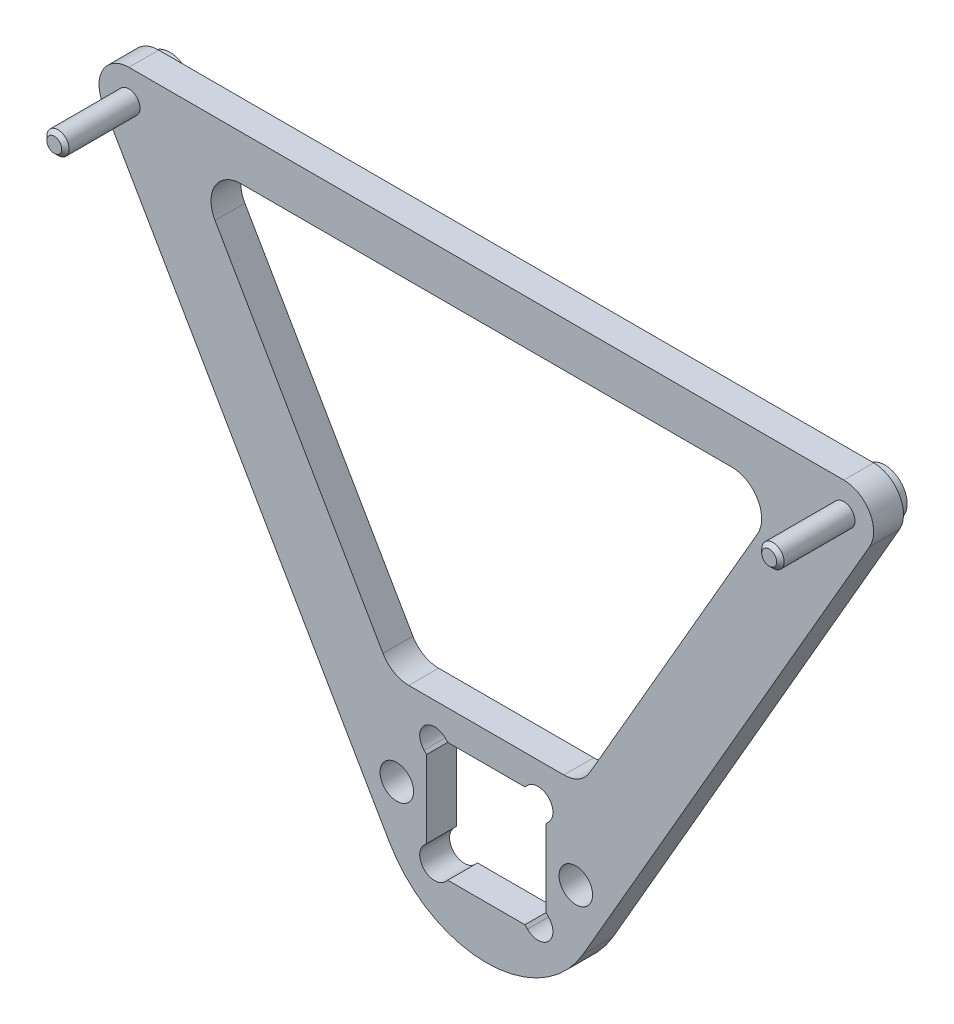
ISO-10303-21;
HEADER;
FILE_DESCRIPTION(('STEP AP214'),'2;1');
FILE_NAME('part.step','',(''),(''),'','','');
FILE_SCHEMA(('AUTOMOTIVE_DESIGN { 1 0 10303 214 1 1 1 1 }'));
ENDSEC;
DATA;
#1=APPLICATION_CONTEXT('core data for automotive mechanical design processes');
#2=APPLICATION_PROTOCOL_DEFINITION('international standard','automotive_design',2000,#1);
#3=PRODUCT_CONTEXT('',#1,'mechanical');
#4=PRODUCT('Part','Part','',(#3));
#5=PRODUCT_RELATED_PRODUCT_CATEGORY('part','',(#4));
#6=PRODUCT_DEFINITION_FORMATION('','',#4);
#7=PRODUCT_DEFINITION_CONTEXT('part definition',#1,'design');
#8=PRODUCT_DEFINITION('design','',#6,#7);
#9=PRODUCT_DEFINITION_SHAPE('','',#8);
#10=(LENGTH_UNIT() NAMED_UNIT(*) SI_UNIT(.MILLI.,.METRE.));
#11=(NAMED_UNIT(*) PLANE_ANGLE_UNIT() SI_UNIT($,.RADIAN.));
#12=(NAMED_UNIT(*) SI_UNIT($,.STERADIAN.) SOLID_ANGLE_UNIT());
#13=UNCERTAINTY_MEASURE_WITH_UNIT(LENGTH_MEASURE(1.E-05),#10,'distance_accuracy_value','');
#14=(GEOMETRIC_REPRESENTATION_CONTEXT(3) GLOBAL_UNCERTAINTY_ASSIGNED_CONTEXT((#13)) GLOBAL_UNIT_ASSIGNED_CONTEXT((#10,
#11,#12)) REPRESENTATION_CONTEXT('',''));
#15=CARTESIAN_POINT('',(0.,0.,0.));
#16=DIRECTION('',(0.,0.,1.));
#17=DIRECTION('',(1.,0.,0.));
#18=AXIS2_PLACEMENT_3D('',#15,#16,#17);
#19=CARTESIAN_POINT('',(47.9200723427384,61.,-2.));
#20=DIRECTION('',(0.,0.,1.));
#21=DIRECTION('',(1.,0.,0.));
#22=AXIS2_PLACEMENT_3D('',#19,#20,#21);
#23=PLANE('',#22);
#24=CARTESIAN_POINT('',(47.9200723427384,61.,-2.));
#25=DIRECTION('',(0.,0.,1.));
#26=DIRECTION('',(1.,0.,0.));
#27=AXIS2_PLACEMENT_3D('',#24,#25,#26);
#28=CIRCLE('',#27,3.);
#29=CARTESIAN_POINT('',(50.9200723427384,61.,-2.));
#30=VERTEX_POINT('',#29);
#31=EDGE_CURVE('E457',#30,#30,#28,.F.);
#32=ORIENTED_EDGE('',*,*,#31,.F.);
#33=EDGE_LOOP('',(#32));
#34=FACE_BOUND('',#33,.T.);
#35=CARTESIAN_POINT('',(-12.,0.,-2.));
#36=DIRECTION('',(0.,0.,1.));
#37=DIRECTION('',(1.,0.,0.));
#38=AXIS2_PLACEMENT_3D('',#35,#36,#37);
#39=CIRCLE('',#38,2.25);
#40=CARTESIAN_POINT('',(-9.75,0.,-2.));
#41=VERTEX_POINT('',#40);
#42=EDGE_CURVE('E995',#41,#41,#39,.T.);
#43=ORIENTED_EDGE('',*,*,#42,.T.);
#44=EDGE_LOOP('',(#43));
#45=FACE_BOUND('',#44,.T.);
#46=DIRECTION('',(0.707106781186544,0.707106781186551,0.));
#47=VECTOR('',#46,1.);
#48=CARTESIAN_POINT('',(8.34386001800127,5.51543289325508,-2.));
#49=LINE('',#48,#47);
#50=CARTESIAN_POINT('',(8.,5.17157287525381,-2.));
#51=VERTEX_POINT('',#50);
#52=CARTESIAN_POINT('',(8.34386001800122,5.51543289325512,-2.));
#53=VERTEX_POINT('',#52);
#54=EDGE_CURVE('E246',#51,#53,#49,.T.);
#55=ORIENTED_EDGE('',*,*,#54,.T.);
#56=CARTESIAN_POINT('',(6.92964645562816,6.92964645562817,-2.));
#57=DIRECTION('',(0.,0.,1.));
#58=DIRECTION('',(1.,0.,0.));
#59=AXIS2_PLACEMENT_3D('',#56,#57,#58);
#60=CIRCLE('',#59,1.99999999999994);
#61=CARTESIAN_POINT('',(5.51543289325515,8.34386001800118,-2.));
#62=VERTEX_POINT('',#61);
#63=EDGE_CURVE('E336',#53,#62,#60,.T.);
#64=ORIENTED_EDGE('',*,*,#63,.T.);
#65=DIRECTION('',(-0.707106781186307,-0.707106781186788,0.));
#66=VECTOR('',#65,1.);
#67=CARTESIAN_POINT('',(5.51543289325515,8.34386001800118,-2.));
#68=LINE('',#67,#66);
#69=CARTESIAN_POINT('',(5.17157287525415,7.99999999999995,-2.));
#70=VERTEX_POINT('',#69);
#71=EDGE_CURVE('E339',#62,#70,#68,.T.);
#72=ORIENTED_EDGE('',*,*,#71,.T.);
#73=DIRECTION('',(-1.,0.,0.));
#74=VECTOR('',#73,1.);
#75=CARTESIAN_POINT('',(-5.17157287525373,8.00000000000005,-2.));
#76=LINE('',#75,#74);
#77=CARTESIAN_POINT('',(-5.17157287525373,8.00000000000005,-2.));
#78=VERTEX_POINT('',#77);
#79=EDGE_CURVE('E342',#70,#78,#76,.T.);
#80=ORIENTED_EDGE('',*,*,#79,.T.);
#81=DIRECTION('',(-0.707106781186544,0.707106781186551,0.));
#82=VECTOR('',#81,1.);
#83=CARTESIAN_POINT('',(-5.515432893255,8.34386001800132,-2.));
#84=LINE('',#83,#82);
#85=CARTESIAN_POINT('',(-5.515432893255,8.34386001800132,-2.));
#86=VERTEX_POINT('',#85);
#87=EDGE_CURVE('E345',#78,#86,#84,.T.);
#88=ORIENTED_EDGE('',*,*,#87,.T.);
#89=CARTESIAN_POINT('',(-6.9296464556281,6.92964645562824,-2.));
#90=DIRECTION('',(0.,0.,1.));
#91=DIRECTION('',(1.,0.,0.));
#92=AXIS2_PLACEMENT_3D('',#89,#90,#91);
#93=CIRCLE('',#92,2.);
#94=CARTESIAN_POINT('',(-8.3438600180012,5.51543289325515,-2.));
#95=VERTEX_POINT('',#94);
#96=EDGE_CURVE('E348',#86,#95,#93,.T.);
#97=ORIENTED_EDGE('',*,*,#96,.T.);
#98=DIRECTION('',(0.70710678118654,-0.707106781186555,0.));
#99=VECTOR('',#98,1.);
#100=CARTESIAN_POINT('',(-8.3438600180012,5.51543289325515,-2.));
#101=LINE('',#100,#99);
#102=CARTESIAN_POINT('',(-7.99999999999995,5.17157287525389,-2.));
#103=VERTEX_POINT('',#102);
#104=EDGE_CURVE('E351',#95,#103,#101,.T.);
#105=ORIENTED_EDGE('',*,*,#104,.T.);
#106=DIRECTION('',(0.,-1.,0.));
#107=VECTOR('',#106,1.);
#108=CARTESIAN_POINT('',(-7.99999999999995,5.17157287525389,-2.));
#109=LINE('',#108,#107);
#110=CARTESIAN_POINT('',(-8.00000000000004,-5.17157287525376,-2.));
#111=VERTEX_POINT('',#110);
#112=EDGE_CURVE('E354',#103,#111,#109,.T.);
#113=ORIENTED_EDGE('',*,*,#112,.T.);
#114=DIRECTION('',(-0.707106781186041,-0.707106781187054,0.));
#115=VECTOR('',#114,1.);
#116=CARTESIAN_POINT('',(-8.34386001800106,-5.51543289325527,-2.));
#117=LINE('',#116,#115);
#118=CARTESIAN_POINT('',(-8.34386001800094,-5.5154328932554,-2.));
#119=VERTEX_POINT('',#118);
#120=EDGE_CURVE('E357',#111,#119,#117,.T.);
#121=ORIENTED_EDGE('',*,*,#120,.T.);
#122=CARTESIAN_POINT('',(-6.92964645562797,-6.92964645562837,-2.));
#123=DIRECTION('',(0.,0.,1.));
#124=DIRECTION('',(1.,0.,0.));
#125=AXIS2_PLACEMENT_3D('',#122,#123,#124);
#126=CIRCLE('',#125,1.99999999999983);
#127=CARTESIAN_POINT('',(-5.51543289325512,-8.34386001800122,-2.));
#128=VERTEX_POINT('',#127);
#129=EDGE_CURVE('E360',#119,#128,#126,.T.);
#130=ORIENTED_EDGE('',*,*,#129,.T.);
#131=DIRECTION('',(0.707106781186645,0.70710678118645,0.));
#132=VECTOR('',#131,1.);
#133=CARTESIAN_POINT('',(-5.51543289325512,-8.34386001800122,-2.));
#134=LINE('',#133,#132);
#135=CARTESIAN_POINT('',(-5.17157287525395,-8.00000000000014,-2.));
#136=VERTEX_POINT('',#135);
#137=EDGE_CURVE('E363',#128,#136,#134,.T.);
#138=ORIENTED_EDGE('',*,*,#137,.T.);
#139=DIRECTION('',(1.,0.,0.));
#140=VECTOR('',#139,1.);
#141=CARTESIAN_POINT('',(-5.17157287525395,-8.00000000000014,-2.));
#142=LINE('',#141,#140);
#143=CARTESIAN_POINT('',(5.17157287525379,-8.00000000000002,-2.));
#144=VERTEX_POINT('',#143);
#145=EDGE_CURVE('E366',#136,#144,#142,.T.);
#146=ORIENTED_EDGE('',*,*,#145,.T.);
#147=DIRECTION('',(0.707106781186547,-0.707106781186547,0.));
#148=VECTOR('',#147,1.);
#149=CARTESIAN_POINT('',(5.51543289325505,-8.34386001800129,-2.));
#150=LINE('',#149,#148);
#151=CARTESIAN_POINT('',(5.51543289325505,-8.34386001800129,-2.));
#152=VERTEX_POINT('',#151);
#153=EDGE_CURVE('E369',#144,#152,#150,.T.);
#154=ORIENTED_EDGE('',*,*,#153,.T.);
#155=CARTESIAN_POINT('',(6.92964645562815,-6.92964645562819,-2.));
#156=DIRECTION('',(0.,0.,1.));
#157=DIRECTION('',(1.,0.,0.));
#158=AXIS2_PLACEMENT_3D('',#155,#156,#157);
#159=CIRCLE('',#158,2.);
#160=CARTESIAN_POINT('',(8.34386001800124,-5.51543289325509,-2.));
#161=VERTEX_POINT('',#160);
#162=EDGE_CURVE('E372',#152,#161,#159,.T.);
#163=ORIENTED_EDGE('',*,*,#162,.T.);
#164=DIRECTION('',(-0.707106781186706,0.707106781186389,0.));
#165=VECTOR('',#164,1.);
#166=CARTESIAN_POINT('',(8.34386001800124,-5.51543289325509,-2.));
#167=LINE('',#166,#165);
#168=CARTESIAN_POINT('',(8.00000000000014,-5.17157287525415,-2.));
#169=VERTEX_POINT('',#168);
#170=EDGE_CURVE('E375',#161,#169,#167,.T.);
#171=ORIENTED_EDGE('',*,*,#170,.T.);
#172=DIRECTION('',(0.,1.,0.));
#173=VECTOR('',#172,1.);
#174=CARTESIAN_POINT('',(8.,5.17157287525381,-2.));
#175=LINE('',#174,#173);
#176=EDGE_CURVE('E302',#169,#51,#175,.T.);
#177=ORIENTED_EDGE('',*,*,#176,.T.);
#178=EDGE_LOOP('',(#55,#64,#72,#80,#88,#97,#105,#113,#121,#130,#138,#146,#154,#163,#171,#177));
#179=FACE_BOUND('',#178,.T.);
#180=CARTESIAN_POINT('',(47.9200723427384,61.,-2.));
#181=DIRECTION('',(0.,0.,1.));
#182=DIRECTION('',(1.,0.,0.));
#183=AXIS2_PLACEMENT_3D('',#180,#181,#182);
#184=CIRCLE('',#183,4.);
#185=CARTESIAN_POINT('',(51.3841739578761,59.,-2.));
#186=VERTEX_POINT('',#185);
#187=CARTESIAN_POINT('',(47.9200723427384,65.,-2.));
#188=VERTEX_POINT('',#187);
#189=EDGE_CURVE('E413',#186,#188,#184,.T.);
#190=ORIENTED_EDGE('',*,*,#189,.F.);
#191=DIRECTION('',(0.499999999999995,0.866025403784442,0.));
#192=VECTOR('',#191,1.);
#193=CARTESIAN_POINT('',(12.9903810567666,-7.49999999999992,-2.));
#194=LINE('',#193,#192);
#195=CARTESIAN_POINT('',(12.9903810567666,-7.49999999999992,-2.));
#196=VERTEX_POINT('',#195);
#197=EDGE_CURVE('E418',#196,#186,#194,.T.);
#198=ORIENTED_EDGE('',*,*,#197,.F.);
#199=CARTESIAN_POINT('',(0.,0.,-2.));
#200=DIRECTION('',(0.,0.,1.));
#201=DIRECTION('',(1.,0.,0.));
#202=AXIS2_PLACEMENT_3D('',#199,#200,#201);
#203=CIRCLE('',#202,15.);
#204=CARTESIAN_POINT('',(-12.9903810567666,-7.49999999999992,-2.));
#205=VERTEX_POINT('',#204);
#206=EDGE_CURVE('E437',#205,#196,#203,.T.);
#207=ORIENTED_EDGE('',*,*,#206,.F.);
#208=DIRECTION('',(0.499999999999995,-0.866025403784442,0.));
#209=VECTOR('',#208,1.);
#210=CARTESIAN_POINT('',(-12.9903810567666,-7.49999999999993,-2.));
#211=LINE('',#210,#209);
#212=CARTESIAN_POINT('',(-51.3841739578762,59.,-2.));
#213=VERTEX_POINT('',#212);
#214=EDGE_CURVE('E435',#213,#205,#211,.T.);
#215=ORIENTED_EDGE('',*,*,#214,.F.);
#216=CARTESIAN_POINT('',(-47.9200723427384,61.,-2.));
#217=DIRECTION('',(0.,0.,1.));
#218=DIRECTION('',(-1.,0.,0.));
#219=AXIS2_PLACEMENT_3D('',#216,#217,#218);
#220=CIRCLE('',#219,4.);
#221=CARTESIAN_POINT('',(-47.9200723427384,65.,-2.));
#222=VERTEX_POINT('',#221);
#223=EDGE_CURVE('E433',#222,#213,#220,.T.);
#224=ORIENTED_EDGE('',*,*,#223,.F.);
#225=DIRECTION('',(-1.,0.,0.));
#226=VECTOR('',#225,1.);
#227=CARTESIAN_POINT('',(-47.9200723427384,65.,-2.));
#228=LINE('',#227,#226);
#229=EDGE_CURVE('E431',#188,#222,#228,.T.);
#230=ORIENTED_EDGE('',*,*,#229,.F.);
#231=EDGE_LOOP('',(#190,#198,#207,#215,#224,#230));
#232=FACE_BOUND('',#231,.T.);
#233=CARTESIAN_POINT('',(-32.9089653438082,55.,-2.));
#234=DIRECTION('',(0.,0.,1.));
#235=DIRECTION('',(-1.,0.,0.));
#236=AXIS2_PLACEMENT_3D('',#233,#234,#235);
#237=CIRCLE('',#236,4.);
#238=CARTESIAN_POINT('',(-32.9089653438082,59.,-2.));
#239=VERTEX_POINT('',#238);
#240=CARTESIAN_POINT('',(-36.373066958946,53.,-2.));
#241=VERTEX_POINT('',#240);
#242=EDGE_CURVE('E56',#239,#241,#237,.T.);
#243=ORIENTED_EDGE('',*,*,#242,.T.);
#244=DIRECTION('',(0.499999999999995,-0.866025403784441,0.));
#245=VECTOR('',#244,1.);
#246=CARTESIAN_POINT('',(-13.856406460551,14.0000000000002,-2.));
#247=LINE('',#246,#245);
#248=CARTESIAN_POINT('',(-13.856406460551,14.0000000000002,-2.));
#249=VERTEX_POINT('',#248);
#250=EDGE_CURVE('E245',#241,#249,#247,.T.);
#251=ORIENTED_EDGE('',*,*,#250,.T.);
#252=CARTESIAN_POINT('',(-10.3923048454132,16.0000000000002,-2.));
#253=DIRECTION('',(0.,0.,1.));
#254=DIRECTION('',(1.,0.,0.));
#255=AXIS2_PLACEMENT_3D('',#252,#253,#254);
#256=CIRCLE('',#255,4.);
#257=CARTESIAN_POINT('',(-10.3923048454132,12.0000000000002,-2.));
#258=VERTEX_POINT('',#257);
#259=EDGE_CURVE('E271',#249,#258,#256,.T.);
#260=ORIENTED_EDGE('',*,*,#259,.T.);
#261=DIRECTION('',(1.,0.,0.));
#262=VECTOR('',#261,1.);
#263=CARTESIAN_POINT('',(10.3923048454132,12.0000000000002,-2.));
#264=LINE('',#263,#262);
#265=CARTESIAN_POINT('',(10.3923048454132,12.0000000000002,-2.));
#266=VERTEX_POINT('',#265);
#267=EDGE_CURVE('E274',#258,#266,#264,.T.);
#268=ORIENTED_EDGE('',*,*,#267,.T.);
#269=CARTESIAN_POINT('',(10.3923048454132,16.0000000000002,-2.));
#270=DIRECTION('',(0.,0.,1.));
#271=DIRECTION('',(-1.,0.,0.));
#272=AXIS2_PLACEMENT_3D('',#269,#270,#271);
#273=CIRCLE('',#272,4.);
#274=CARTESIAN_POINT('',(13.856406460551,14.0000000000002,-2.));
#275=VERTEX_POINT('',#274);
#276=EDGE_CURVE('E277',#266,#275,#273,.T.);
#277=ORIENTED_EDGE('',*,*,#276,.T.);
#278=DIRECTION('',(0.499999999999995,0.866025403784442,0.));
#279=VECTOR('',#278,1.);
#280=CARTESIAN_POINT('',(13.856406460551,14.0000000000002,-2.));
#281=LINE('',#280,#279);
#282=CARTESIAN_POINT('',(36.373066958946,53.,-2.));
#283=VERTEX_POINT('',#282);
#284=EDGE_CURVE('E280',#275,#283,#281,.T.);
#285=ORIENTED_EDGE('',*,*,#284,.T.);
#286=CARTESIAN_POINT('',(32.9089653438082,55.,-2.));
#287=DIRECTION('',(0.,0.,1.));
#288=DIRECTION('',(1.,0.,0.));
#289=AXIS2_PLACEMENT_3D('',#286,#287,#288);
#290=CIRCLE('',#289,4.);
#291=CARTESIAN_POINT('',(32.9089653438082,59.,-2.));
#292=VERTEX_POINT('',#291);
#293=EDGE_CURVE('E283',#283,#292,#290,.T.);
#294=ORIENTED_EDGE('',*,*,#293,.T.);
#295=DIRECTION('',(-1.,0.,0.));
#296=VECTOR('',#295,1.);
#297=CARTESIAN_POINT('',(-32.9089653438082,59.,-2.));
#298=LINE('',#297,#296);
#299=EDGE_CURVE('E239',#292,#239,#298,.T.);
#300=ORIENTED_EDGE('',*,*,#299,.T.);
#301=EDGE_LOOP('',(#243,#251,#260,#268,#277,#285,#294,#300));
#302=FACE_BOUND('',#301,.T.);
#303=CARTESIAN_POINT('',(12.,0.,-2.));
#304=DIRECTION('',(0.,0.,1.));
#305=DIRECTION('',(1.,0.,0.));
#306=AXIS2_PLACEMENT_3D('',#303,#304,#305);
#307=CIRCLE('',#306,2.25);
#308=CARTESIAN_POINT('',(14.25,0.,-2.));
#309=VERTEX_POINT('',#308);
#310=EDGE_CURVE('E543',#309,#309,#307,.T.);
#311=ORIENTED_EDGE('',*,*,#310,.T.);
#312=EDGE_LOOP('',(#311));
#313=FACE_BOUND('',#312,.T.);
#314=CARTESIAN_POINT('',(-47.9200723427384,61.,-2.));
#315=DIRECTION('',(0.,0.,1.));
#316=DIRECTION('',(1.,0.,0.));
#317=AXIS2_PLACEMENT_3D('',#314,#315,#316);
#318=CIRCLE('',#317,3.);
#319=CARTESIAN_POINT('',(-44.9200723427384,61.,-2.));
#320=VERTEX_POINT('',#319);
#321=EDGE_CURVE('E460',#320,#320,#318,.F.);
#322=ORIENTED_EDGE('',*,*,#321,.F.);
#323=EDGE_LOOP('',(#322));
#324=FACE_BOUND('',#323,.T.);
#325=ADVANCED_FACE('F33',(#34,#45,#179,#232,#302,#313,#324),#23,.F.);
#326=CARTESIAN_POINT('',(47.9200723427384,61.,2.));
#327=DIRECTION('',(0.,0.,1.));
#328=DIRECTION('',(1.,0.,0.));
#329=AXIS2_PLACEMENT_3D('',#326,#327,#328);
#330=PLANE('',#329);
#331=CARTESIAN_POINT('',(-47.9200723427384,61.,2.));
#332=DIRECTION('',(0.,0.,1.));
#333=DIRECTION('',(1.,0.,0.));
#334=AXIS2_PLACEMENT_3D('',#331,#332,#333);
#335=CIRCLE('',#334,1.5);
#336=CARTESIAN_POINT('',(-46.4200723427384,61.,2.));
#337=VERTEX_POINT('',#336);
#338=EDGE_CURVE('E1001',#337,#337,#335,.T.);
#339=ORIENTED_EDGE('',*,*,#338,.F.);
#340=EDGE_LOOP('',(#339));
#341=FACE_BOUND('',#340,.T.);
#342=CARTESIAN_POINT('',(-12.,0.,2.));
#343=DIRECTION('',(0.,0.,1.));
#344=DIRECTION('',(1.,0.,0.));
#345=AXIS2_PLACEMENT_3D('',#342,#343,#344);
#346=CIRCLE('',#345,2.25);
#347=CARTESIAN_POINT('',(-9.75,0.,2.));
#348=VERTEX_POINT('',#347);
#349=EDGE_CURVE('E269',#348,#348,#346,.T.);
#350=ORIENTED_EDGE('',*,*,#349,.F.);
#351=EDGE_LOOP('',(#350));
#352=FACE_BOUND('',#351,.T.);
#353=CARTESIAN_POINT('',(6.92964645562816,6.92964645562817,2.));
#354=DIRECTION('',(0.,0.,1.));
#355=DIRECTION('',(1.,0.,0.));
#356=AXIS2_PLACEMENT_3D('',#353,#354,#355);
#357=CIRCLE('',#356,1.99999999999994);
#358=CARTESIAN_POINT('',(8.34386001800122,5.51543289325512,2.));
#359=VERTEX_POINT('',#358);
#360=CARTESIAN_POINT('',(5.51543289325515,8.34386001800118,2.));
#361=VERTEX_POINT('',#360);
#362=EDGE_CURVE('E301',#359,#361,#357,.T.);
#363=ORIENTED_EDGE('',*,*,#362,.F.);
#364=DIRECTION('',(0.707106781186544,0.707106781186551,0.));
#365=VECTOR('',#364,1.);
#366=CARTESIAN_POINT('',(8.34386001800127,5.51543289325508,2.));
#367=LINE('',#366,#365);
#368=CARTESIAN_POINT('',(8.,5.17157287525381,2.));
#369=VERTEX_POINT('',#368);
#370=EDGE_CURVE('E299',#369,#359,#367,.T.);
#371=ORIENTED_EDGE('',*,*,#370,.F.);
#372=DIRECTION('',(0.,1.,0.));
#373=VECTOR('',#372,1.);
#374=CARTESIAN_POINT('',(8.,5.17157287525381,2.));
#375=LINE('',#374,#373);
#376=CARTESIAN_POINT('',(8.00000000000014,-5.17157287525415,2.));
#377=VERTEX_POINT('',#376);
#378=EDGE_CURVE('E331',#377,#369,#375,.T.);
#379=ORIENTED_EDGE('',*,*,#378,.F.);
#380=DIRECTION('',(-0.707106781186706,0.707106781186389,0.));
#381=VECTOR('',#380,1.);
#382=CARTESIAN_POINT('',(8.34386001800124,-5.51543289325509,2.));
#383=LINE('',#382,#381);
#384=CARTESIAN_POINT('',(8.34386001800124,-5.51543289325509,2.));
#385=VERTEX_POINT('',#384);
#386=EDGE_CURVE('E328',#385,#377,#383,.T.);
#387=ORIENTED_EDGE('',*,*,#386,.F.);
#388=CARTESIAN_POINT('',(6.92964645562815,-6.92964645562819,2.));
#389=DIRECTION('',(0.,0.,1.));
#390=DIRECTION('',(1.,0.,0.));
#391=AXIS2_PLACEMENT_3D('',#388,#389,#390);
#392=CIRCLE('',#391,2.);
#393=CARTESIAN_POINT('',(5.51543289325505,-8.34386001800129,2.));
#394=VERTEX_POINT('',#393);
#395=EDGE_CURVE('E326',#394,#385,#392,.T.);
#396=ORIENTED_EDGE('',*,*,#395,.F.);
#397=DIRECTION('',(0.707106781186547,-0.707106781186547,0.));
#398=VECTOR('',#397,1.);
#399=CARTESIAN_POINT('',(5.51543289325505,-8.34386001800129,2.));
#400=LINE('',#399,#398);
#401=CARTESIAN_POINT('',(5.17157287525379,-8.00000000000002,2.));
#402=VERTEX_POINT('',#401);
#403=EDGE_CURVE('E324',#402,#394,#400,.T.);
#404=ORIENTED_EDGE('',*,*,#403,.F.);
#405=DIRECTION('',(1.,0.,0.));
#406=VECTOR('',#405,1.);
#407=CARTESIAN_POINT('',(-5.17157287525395,-8.00000000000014,2.));
#408=LINE('',#407,#406);
#409=CARTESIAN_POINT('',(-5.17157287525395,-8.00000000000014,2.));
#410=VERTEX_POINT('',#409);
#411=EDGE_CURVE('E322',#410,#402,#408,.T.);
#412=ORIENTED_EDGE('',*,*,#411,.F.);
#413=DIRECTION('',(0.707106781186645,0.70710678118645,0.));
#414=VECTOR('',#413,1.);
#415=CARTESIAN_POINT('',(-5.51543289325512,-8.34386001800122,2.));
#416=LINE('',#415,#414);
#417=CARTESIAN_POINT('',(-5.51543289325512,-8.34386001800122,2.));
#418=VERTEX_POINT('',#417);
#419=EDGE_CURVE('E320',#418,#410,#416,.T.);
#420=ORIENTED_EDGE('',*,*,#419,.F.);
#421=CARTESIAN_POINT('',(-6.92964645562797,-6.92964645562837,2.));
#422=DIRECTION('',(0.,0.,1.));
#423=DIRECTION('',(1.,0.,0.));
#424=AXIS2_PLACEMENT_3D('',#421,#422,#423);
#425=CIRCLE('',#424,1.99999999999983);
#426=CARTESIAN_POINT('',(-8.34386001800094,-5.5154328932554,2.));
#427=VERTEX_POINT('',#426);
#428=EDGE_CURVE('E318',#427,#418,#425,.T.);
#429=ORIENTED_EDGE('',*,*,#428,.F.);
#430=DIRECTION('',(-0.707106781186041,-0.707106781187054,0.));
#431=VECTOR('',#430,1.);
#432=CARTESIAN_POINT('',(-8.34386001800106,-5.51543289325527,2.));
#433=LINE('',#432,#431);
#434=CARTESIAN_POINT('',(-8.00000000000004,-5.17157287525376,2.));
#435=VERTEX_POINT('',#434);
#436=EDGE_CURVE('E316',#435,#427,#433,.T.);
#437=ORIENTED_EDGE('',*,*,#436,.F.);
#438=DIRECTION('',(0.,-1.,0.));
#439=VECTOR('',#438,1.);
#440=CARTESIAN_POINT('',(-7.99999999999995,5.17157287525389,2.));
#441=LINE('',#440,#439);
#442=CARTESIAN_POINT('',(-7.99999999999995,5.17157287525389,2.));
#443=VERTEX_POINT('',#442);
#444=EDGE_CURVE('E314',#443,#435,#441,.T.);
#445=ORIENTED_EDGE('',*,*,#444,.F.);
#446=DIRECTION('',(0.70710678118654,-0.707106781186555,0.));
#447=VECTOR('',#446,1.);
#448=CARTESIAN_POINT('',(-8.3438600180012,5.51543289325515,2.));
#449=LINE('',#448,#447);
#450=CARTESIAN_POINT('',(-8.3438600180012,5.51543289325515,2.));
#451=VERTEX_POINT('',#450);
#452=EDGE_CURVE('E312',#451,#443,#449,.T.);
#453=ORIENTED_EDGE('',*,*,#452,.F.);
#454=CARTESIAN_POINT('',(-6.9296464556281,6.92964645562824,2.));
#455=DIRECTION('',(0.,0.,1.));
#456=DIRECTION('',(1.,0.,0.));
#457=AXIS2_PLACEMENT_3D('',#454,#455,#456);
#458=CIRCLE('',#457,2.);
#459=CARTESIAN_POINT('',(-5.515432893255,8.34386001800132,2.));
#460=VERTEX_POINT('',#459);
#461=EDGE_CURVE('E310',#460,#451,#458,.T.);
#462=ORIENTED_EDGE('',*,*,#461,.F.);
#463=DIRECTION('',(-0.707106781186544,0.707106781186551,0.));
#464=VECTOR('',#463,1.);
#465=CARTESIAN_POINT('',(-5.515432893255,8.34386001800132,2.));
#466=LINE('',#465,#464);
#467=CARTESIAN_POINT('',(-5.17157287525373,8.00000000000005,2.));
#468=VERTEX_POINT('',#467);
#469=EDGE_CURVE('E308',#468,#460,#466,.T.);
#470=ORIENTED_EDGE('',*,*,#469,.F.);
#471=DIRECTION('',(-1.,0.,0.));
#472=VECTOR('',#471,1.);
#473=CARTESIAN_POINT('',(-5.17157287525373,8.00000000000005,2.));
#474=LINE('',#473,#472);
#475=CARTESIAN_POINT('',(5.17157287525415,7.99999999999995,2.));
#476=VERTEX_POINT('',#475);
#477=EDGE_CURVE('E306',#476,#468,#474,.T.);
#478=ORIENTED_EDGE('',*,*,#477,.F.);
#479=DIRECTION('',(-0.707106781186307,-0.707106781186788,0.));
#480=VECTOR('',#479,1.);
#481=CARTESIAN_POINT('',(5.51543289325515,8.34386001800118,2.));
#482=LINE('',#481,#480);
#483=EDGE_CURVE('E304',#361,#476,#482,.T.);
#484=ORIENTED_EDGE('',*,*,#483,.F.);
#485=EDGE_LOOP('',(#363,#371,#379,#387,#396,#404,#412,#420,#429,#437,#445,#453,#462,#470,#478,#484));
#486=FACE_BOUND('',#485,.T.);
#487=CARTESIAN_POINT('',(47.9200723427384,61.,2.));
#488=DIRECTION('',(0.,0.,1.));
#489=DIRECTION('',(1.,0.,0.));
#490=AXIS2_PLACEMENT_3D('',#487,#488,#489);
#491=CIRCLE('',#490,4.);
#492=CARTESIAN_POINT('',(51.3841739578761,59.,2.));
#493=VERTEX_POINT('',#492);
#494=CARTESIAN_POINT('',(47.9200723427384,65.,2.));
#495=VERTEX_POINT('',#494);
#496=EDGE_CURVE('E414',#493,#495,#491,.T.);
#497=ORIENTED_EDGE('',*,*,#496,.T.);
#498=DIRECTION('',(-1.,0.,0.));
#499=VECTOR('',#498,1.);
#500=CARTESIAN_POINT('',(-47.9200723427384,65.,2.));
#501=LINE('',#500,#499);
#502=CARTESIAN_POINT('',(-47.9200723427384,65.,2.));
#503=VERTEX_POINT('',#502);
#504=EDGE_CURVE('E417',#495,#503,#501,.T.);
#505=ORIENTED_EDGE('',*,*,#504,.T.);
#506=CARTESIAN_POINT('',(-47.9200723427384,61.,2.));
#507=DIRECTION('',(0.,0.,1.));
#508=DIRECTION('',(-1.,0.,0.));
#509=AXIS2_PLACEMENT_3D('',#506,#507,#508);
#510=CIRCLE('',#509,4.);
#511=CARTESIAN_POINT('',(-51.3841739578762,59.,2.));
#512=VERTEX_POINT('',#511);
#513=EDGE_CURVE('E420',#503,#512,#510,.T.);
#514=ORIENTED_EDGE('',*,*,#513,.T.);
#515=DIRECTION('',(0.499999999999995,-0.866025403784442,0.));
#516=VECTOR('',#515,1.);
#517=CARTESIAN_POINT('',(-12.9903810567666,-7.49999999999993,2.));
#518=LINE('',#517,#516);
#519=CARTESIAN_POINT('',(-12.9903810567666,-7.49999999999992,2.));
#520=VERTEX_POINT('',#519);
#521=EDGE_CURVE('E422',#512,#520,#518,.T.);
#522=ORIENTED_EDGE('',*,*,#521,.T.);
#523=CARTESIAN_POINT('',(0.,0.,2.));
#524=DIRECTION('',(0.,0.,1.));
#525=DIRECTION('',(1.,0.,0.));
#526=AXIS2_PLACEMENT_3D('',#523,#524,#525);
#527=CIRCLE('',#526,15.);
#528=CARTESIAN_POINT('',(12.9903810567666,-7.49999999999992,2.));
#529=VERTEX_POINT('',#528);
#530=EDGE_CURVE('E424',#520,#529,#527,.T.);
#531=ORIENTED_EDGE('',*,*,#530,.T.);
#532=DIRECTION('',(0.499999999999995,0.866025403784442,0.));
#533=VECTOR('',#532,1.);
#534=CARTESIAN_POINT('',(12.9903810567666,-7.49999999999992,2.));
#535=LINE('',#534,#533);
#536=EDGE_CURVE('E426',#529,#493,#535,.T.);
#537=ORIENTED_EDGE('',*,*,#536,.T.);
#538=EDGE_LOOP('',(#497,#505,#514,#522,#531,#537));
#539=FACE_BOUND('',#538,.T.);
#540=DIRECTION('',(0.499999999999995,-0.866025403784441,0.));
#541=VECTOR('',#540,1.);
#542=CARTESIAN_POINT('',(-13.856406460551,14.0000000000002,2.));
#543=LINE('',#542,#541);
#544=CARTESIAN_POINT('',(-36.373066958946,53.,2.));
#545=VERTEX_POINT('',#544);
#546=CARTESIAN_POINT('',(-13.856406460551,14.0000000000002,2.));
#547=VERTEX_POINT('',#546);
#548=EDGE_CURVE('E238',#545,#547,#543,.T.);
#549=ORIENTED_EDGE('',*,*,#548,.F.);
#550=CARTESIAN_POINT('',(-32.9089653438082,55.,2.));
#551=DIRECTION('',(0.,0.,1.));
#552=DIRECTION('',(-1.,0.,0.));
#553=AXIS2_PLACEMENT_3D('',#550,#551,#552);
#554=CIRCLE('',#553,4.);
#555=CARTESIAN_POINT('',(-32.9089653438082,59.,2.));
#556=VERTEX_POINT('',#555);
#557=EDGE_CURVE('E230',#556,#545,#554,.T.);
#558=ORIENTED_EDGE('',*,*,#557,.F.);
#559=DIRECTION('',(-1.,0.,0.));
#560=VECTOR('',#559,1.);
#561=CARTESIAN_POINT('',(-32.9089653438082,59.,2.));
#562=LINE('',#561,#560);
#563=CARTESIAN_POINT('',(32.9089653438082,59.,2.));
#564=VERTEX_POINT('',#563);
#565=EDGE_CURVE('E266',#564,#556,#562,.T.);
#566=ORIENTED_EDGE('',*,*,#565,.F.);
#567=CARTESIAN_POINT('',(32.9089653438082,55.,2.));
#568=DIRECTION('',(0.,0.,1.));
#569=DIRECTION('',(1.,0.,0.));
#570=AXIS2_PLACEMENT_3D('',#567,#568,#569);
#571=CIRCLE('',#570,4.);
#572=CARTESIAN_POINT('',(36.373066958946,53.,2.));
#573=VERTEX_POINT('',#572);
#574=EDGE_CURVE('E264',#573,#564,#571,.T.);
#575=ORIENTED_EDGE('',*,*,#574,.F.);
#576=DIRECTION('',(0.499999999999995,0.866025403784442,0.));
#577=VECTOR('',#576,1.);
#578=CARTESIAN_POINT('',(13.856406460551,14.0000000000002,2.));
#579=LINE('',#578,#577);
#580=CARTESIAN_POINT('',(13.856406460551,14.0000000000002,2.));
#581=VERTEX_POINT('',#580);
#582=EDGE_CURVE('E262',#581,#573,#579,.T.);
#583=ORIENTED_EDGE('',*,*,#582,.F.);
#584=CARTESIAN_POINT('',(10.3923048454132,16.0000000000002,2.));
#585=DIRECTION('',(0.,0.,1.));
#586=DIRECTION('',(-1.,0.,0.));
#587=AXIS2_PLACEMENT_3D('',#584,#585,#586);
#588=CIRCLE('',#587,4.);
#589=CARTESIAN_POINT('',(10.3923048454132,12.0000000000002,2.));
#590=VERTEX_POINT('',#589);
#591=EDGE_CURVE('E260',#590,#581,#588,.T.);
#592=ORIENTED_EDGE('',*,*,#591,.F.);
#593=DIRECTION('',(1.,0.,0.));
#594=VECTOR('',#593,1.);
#595=CARTESIAN_POINT('',(10.3923048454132,12.0000000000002,2.));
#596=LINE('',#595,#594);
#597=CARTESIAN_POINT('',(-10.3923048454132,12.0000000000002,2.));
#598=VERTEX_POINT('',#597);
#599=EDGE_CURVE('E255',#598,#590,#596,.T.);
#600=ORIENTED_EDGE('',*,*,#599,.F.);
#601=CARTESIAN_POINT('',(-10.3923048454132,16.0000000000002,2.));
#602=DIRECTION('',(0.,0.,1.));
#603=DIRECTION('',(1.,0.,0.));
#604=AXIS2_PLACEMENT_3D('',#601,#602,#603);
#605=CIRCLE('',#604,4.);
#606=EDGE_CURVE('E253',#547,#598,#605,.T.);
#607=ORIENTED_EDGE('',*,*,#606,.F.);
#608=EDGE_LOOP('',(#549,#558,#566,#575,#583,#592,#600,#607));
#609=FACE_BOUND('',#608,.T.);
#610=CARTESIAN_POINT('',(12.,0.,2.));
#611=DIRECTION('',(0.,0.,1.));
#612=DIRECTION('',(1.,0.,0.));
#613=AXIS2_PLACEMENT_3D('',#610,#611,#612);
#614=CIRCLE('',#613,2.25);
#615=CARTESIAN_POINT('',(14.25,0.,2.));
#616=VERTEX_POINT('',#615);
#617=EDGE_CURVE('E996',#616,#616,#614,.T.);
#618=ORIENTED_EDGE('',*,*,#617,.F.);
#619=EDGE_LOOP('',(#618));
#620=FACE_BOUND('',#619,.T.);
#621=CARTESIAN_POINT('',(47.9200723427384,61.,2.));
#622=DIRECTION('',(0.,0.,1.));
#623=DIRECTION('',(1.,0.,0.));
#624=AXIS2_PLACEMENT_3D('',#621,#622,#623);
#625=CIRCLE('',#624,1.5);
#626=CARTESIAN_POINT('',(49.4200723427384,61.,2.));
#627=VERTEX_POINT('',#626);
#628=EDGE_CURVE('E1005',#627,#627,#625,.T.);
#629=ORIENTED_EDGE('',*,*,#628,.F.);
#630=EDGE_LOOP('',(#629));
#631=FACE_BOUND('',#630,.T.);
#632=ADVANCED_FACE('F250',(#341,#352,#486,#539,#609,#620,#631),#330,.T.);
#633=CARTESIAN_POINT('',(47.9200723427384,61.,2.));
#634=DIRECTION('',(0.,0.,-1.));
#635=DIRECTION('',(-1.,0.,0.));
#636=AXIS2_PLACEMENT_3D('',#633,#634,#635);
#637=CYLINDRICAL_SURFACE('',#636,4.);
#638=ORIENTED_EDGE('',*,*,#189,.T.);
#639=DIRECTION('',(0.,0.,-1.));
#640=VECTOR('',#639,1.);
#641=CARTESIAN_POINT('',(47.9200723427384,65.,2.));
#642=LINE('',#641,#640);
#643=EDGE_CURVE('E454',#495,#188,#642,.T.);
#644=ORIENTED_EDGE('',*,*,#643,.F.);
#645=ORIENTED_EDGE('',*,*,#496,.F.);
#646=DIRECTION('',(0.,0.,-1.));
#647=VECTOR('',#646,1.);
#648=CARTESIAN_POINT('',(51.3841739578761,59.,2.));
#649=LINE('',#648,#647);
#650=EDGE_CURVE('E428',#493,#186,#649,.T.);
#651=ORIENTED_EDGE('',*,*,#650,.T.);
#652=EDGE_LOOP('',(#638,#644,#645,#651));
#653=FACE_BOUND('',#652,.T.);
#654=ADVANCED_FACE('F488',(#653),#637,.T.);
#655=CARTESIAN_POINT('',(-47.9200723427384,65.,2.));
#656=DIRECTION('',(0.,-1.,0.));
#657=DIRECTION('',(1.,0.,0.));
#658=AXIS2_PLACEMENT_3D('',#655,#656,#657);
#659=PLANE('',#658);
#660=ORIENTED_EDGE('',*,*,#229,.T.);
#661=DIRECTION('',(0.,0.,-1.));
#662=VECTOR('',#661,1.);
#663=CARTESIAN_POINT('',(-47.9200723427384,65.,2.));
#664=LINE('',#663,#662);
#665=EDGE_CURVE('E451',#503,#222,#664,.T.);
#666=ORIENTED_EDGE('',*,*,#665,.F.);
#667=ORIENTED_EDGE('',*,*,#504,.F.);
#668=ORIENTED_EDGE('',*,*,#643,.T.);
#669=EDGE_LOOP('',(#660,#666,#667,#668));
#670=FACE_BOUND('',#669,.T.);
#671=ADVANCED_FACE('F511',(#670),#659,.F.);
#672=CARTESIAN_POINT('',(-47.9200723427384,61.,2.));
#673=DIRECTION('',(0.,0.,-1.));
#674=DIRECTION('',(-1.,0.,0.));
#675=AXIS2_PLACEMENT_3D('',#672,#673,#674);
#676=CYLINDRICAL_SURFACE('',#675,4.);
#677=ORIENTED_EDGE('',*,*,#223,.T.);
#678=DIRECTION('',(0.,0.,-1.));
#679=VECTOR('',#678,1.);
#680=CARTESIAN_POINT('',(-51.3841739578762,59.,2.));
#681=LINE('',#680,#679);
#682=EDGE_CURVE('E448',#512,#213,#681,.T.);
#683=ORIENTED_EDGE('',*,*,#682,.F.);
#684=ORIENTED_EDGE('',*,*,#513,.F.);
#685=ORIENTED_EDGE('',*,*,#665,.T.);
#686=EDGE_LOOP('',(#677,#683,#684,#685));
#687=FACE_BOUND('',#686,.T.);
#688=ADVANCED_FACE('F507',(#687),#676,.T.);
#689=CARTESIAN_POINT('',(-12.9903810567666,-7.49999999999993,2.));
#690=DIRECTION('',(0.866025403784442,0.499999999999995,0.));
#691=DIRECTION('',(-0.499999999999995,0.866025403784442,0.));
#692=AXIS2_PLACEMENT_3D('',#689,#690,#691);
#693=PLANE('',#692);
#694=ORIENTED_EDGE('',*,*,#214,.T.);
#695=DIRECTION('',(0.,0.,-1.));
#696=VECTOR('',#695,1.);
#697=CARTESIAN_POINT('',(-12.9903810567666,-7.49999999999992,2.));
#698=LINE('',#697,#696);
#699=EDGE_CURVE('E445',#520,#205,#698,.T.);
#700=ORIENTED_EDGE('',*,*,#699,.F.);
#701=ORIENTED_EDGE('',*,*,#521,.F.);
#702=ORIENTED_EDGE('',*,*,#682,.T.);
#703=EDGE_LOOP('',(#694,#700,#701,#702));
#704=FACE_BOUND('',#703,.T.);
#705=ADVANCED_FACE('F503',(#704),#693,.F.);
#706=CARTESIAN_POINT('',(0.,0.,2.));
#707=DIRECTION('',(0.,0.,-1.));
#708=DIRECTION('',(-1.,0.,0.));
#709=AXIS2_PLACEMENT_3D('',#706,#707,#708);
#710=CYLINDRICAL_SURFACE('',#709,15.);
#711=ORIENTED_EDGE('',*,*,#206,.T.);
#712=DIRECTION('',(0.,0.,-1.));
#713=VECTOR('',#712,1.);
#714=CARTESIAN_POINT('',(12.9903810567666,-7.49999999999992,2.));
#715=LINE('',#714,#713);
#716=EDGE_CURVE('E442',#529,#196,#715,.T.);
#717=ORIENTED_EDGE('',*,*,#716,.F.);
#718=ORIENTED_EDGE('',*,*,#530,.F.);
#719=ORIENTED_EDGE('',*,*,#699,.T.);
#720=EDGE_LOOP('',(#711,#717,#718,#719));
#721=FACE_BOUND('',#720,.T.);
#722=ADVANCED_FACE('F499',(#721),#710,.T.);
#723=CARTESIAN_POINT('',(12.9903810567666,-7.49999999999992,2.));
#724=DIRECTION('',(-0.866025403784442,0.499999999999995,0.));
#725=DIRECTION('',(-0.499999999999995,-0.866025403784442,0.));
#726=AXIS2_PLACEMENT_3D('',#723,#724,#725);
#727=PLANE('',#726);
#728=ORIENTED_EDGE('',*,*,#197,.T.);
#729=ORIENTED_EDGE('',*,*,#650,.F.);
#730=ORIENTED_EDGE('',*,*,#536,.F.);
#731=ORIENTED_EDGE('',*,*,#716,.T.);
#732=EDGE_LOOP('',(#728,#729,#730,#731));
#733=FACE_BOUND('',#732,.T.);
#734=ADVANCED_FACE('F495',(#733),#727,.F.);
#735=CARTESIAN_POINT('',(8.34386001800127,5.51543289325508,2.));
#736=DIRECTION('',(-0.707106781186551,0.707106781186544,0.));
#737=DIRECTION('',(-0.707106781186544,-0.707106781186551,0.));
#738=AXIS2_PLACEMENT_3D('',#735,#736,#737);
#739=PLANE('',#738);
#740=ORIENTED_EDGE('',*,*,#54,.F.);
#741=DIRECTION('',(0.,0.,-1.));
#742=VECTOR('',#741,1.);
#743=CARTESIAN_POINT('',(8.,5.17157287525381,2.));
#744=LINE('',#743,#742);
#745=EDGE_CURVE('E333',#369,#51,#744,.T.);
#746=ORIENTED_EDGE('',*,*,#745,.F.);
#747=ORIENTED_EDGE('',*,*,#370,.T.);
#748=DIRECTION('',(0.,0.,-1.));
#749=VECTOR('',#748,1.);
#750=CARTESIAN_POINT('',(8.34386001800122,5.51543289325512,2.));
#751=LINE('',#750,#749);
#752=EDGE_CURVE('E410',#359,#53,#751,.T.);
#753=ORIENTED_EDGE('',*,*,#752,.T.);
#754=EDGE_LOOP('',(#740,#746,#747,#753));
#755=FACE_BOUND('',#754,.T.);
#756=ADVANCED_FACE('F498',(#755),#739,.T.);
#757=CARTESIAN_POINT('',(6.92964645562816,6.92964645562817,2.));
#758=DIRECTION('',(0.,0.,-1.));
#759=DIRECTION('',(-1.,0.,0.));
#760=AXIS2_PLACEMENT_3D('',#757,#758,#759);
#761=CYLINDRICAL_SURFACE('',#760,1.99999999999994);
#762=ORIENTED_EDGE('',*,*,#63,.F.);
#763=ORIENTED_EDGE('',*,*,#752,.F.);
#764=ORIENTED_EDGE('',*,*,#362,.T.);
#765=DIRECTION('',(0.,0.,-1.));
#766=VECTOR('',#765,1.);
#767=CARTESIAN_POINT('',(5.51543289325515,8.34386001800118,2.));
#768=LINE('',#767,#766);
#769=EDGE_CURVE('E408',#361,#62,#768,.T.);
#770=ORIENTED_EDGE('',*,*,#769,.T.);
#771=EDGE_LOOP('',(#762,#763,#764,#770));
#772=FACE_BOUND('',#771,.T.);
#773=ADVANCED_FACE('F669',(#772),#761,.F.);
#774=CARTESIAN_POINT('',(5.51543289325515,8.34386001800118,2.));
#775=DIRECTION('',(0.707106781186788,-0.707106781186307,0.));
#776=DIRECTION('',(0.707106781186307,0.707106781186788,0.));
#777=AXIS2_PLACEMENT_3D('',#774,#775,#776);
#778=PLANE('',#777);
#779=ORIENTED_EDGE('',*,*,#71,.F.);
#780=ORIENTED_EDGE('',*,*,#769,.F.);
#781=ORIENTED_EDGE('',*,*,#483,.T.);
#782=DIRECTION('',(0.,0.,-1.));
#783=VECTOR('',#782,1.);
#784=CARTESIAN_POINT('',(5.17157287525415,7.99999999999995,2.));
#785=LINE('',#784,#783);
#786=EDGE_CURVE('E406',#476,#70,#785,.T.);
#787=ORIENTED_EDGE('',*,*,#786,.T.);
#788=EDGE_LOOP('',(#779,#780,#781,#787));
#789=FACE_BOUND('',#788,.T.);
#790=ADVANCED_FACE('F665',(#789),#778,.T.);
#791=CARTESIAN_POINT('',(-5.17157287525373,8.00000000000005,2.));
#792=DIRECTION('',(0.,-1.,0.));
#793=DIRECTION('',(1.,0.,0.));
#794=AXIS2_PLACEMENT_3D('',#791,#792,#793);
#795=PLANE('',#794);
#796=ORIENTED_EDGE('',*,*,#79,.F.);
#797=ORIENTED_EDGE('',*,*,#786,.F.);
#798=ORIENTED_EDGE('',*,*,#477,.T.);
#799=DIRECTION('',(0.,0.,-1.));
#800=VECTOR('',#799,1.);
#801=CARTESIAN_POINT('',(-5.17157287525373,8.00000000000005,2.));
#802=LINE('',#801,#800);
#803=EDGE_CURVE('E404',#468,#78,#802,.T.);
#804=ORIENTED_EDGE('',*,*,#803,.T.);
#805=EDGE_LOOP('',(#796,#797,#798,#804));
#806=FACE_BOUND('',#805,.T.);
#807=ADVANCED_FACE('F661',(#806),#795,.T.);
#808=CARTESIAN_POINT('',(-5.515432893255,8.34386001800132,2.));
#809=DIRECTION('',(-0.707106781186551,-0.707106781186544,0.));
#810=DIRECTION('',(0.707106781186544,-0.707106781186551,0.));
#811=AXIS2_PLACEMENT_3D('',#808,#809,#810);
#812=PLANE('',#811);
#813=ORIENTED_EDGE('',*,*,#87,.F.);
#814=ORIENTED_EDGE('',*,*,#803,.F.);
#815=ORIENTED_EDGE('',*,*,#469,.T.);
#816=DIRECTION('',(0.,0.,-1.));
#817=VECTOR('',#816,1.);
#818=CARTESIAN_POINT('',(-5.515432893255,8.34386001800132,2.));
#819=LINE('',#818,#817);
#820=EDGE_CURVE('E402',#460,#86,#819,.T.);
#821=ORIENTED_EDGE('',*,*,#820,.T.);
#822=EDGE_LOOP('',(#813,#814,#815,#821));
#823=FACE_BOUND('',#822,.T.);
#824=ADVANCED_FACE('F657',(#823),#812,.T.);
#825=CARTESIAN_POINT('',(-6.9296464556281,6.92964645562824,2.));
#826=DIRECTION('',(0.,0.,-1.));
#827=DIRECTION('',(-1.,0.,0.));
#828=AXIS2_PLACEMENT_3D('',#825,#826,#827);
#829=CYLINDRICAL_SURFACE('',#828,2.);
#830=ORIENTED_EDGE('',*,*,#96,.F.);
#831=ORIENTED_EDGE('',*,*,#820,.F.);
#832=ORIENTED_EDGE('',*,*,#461,.T.);
#833=DIRECTION('',(0.,0.,-1.));
#834=VECTOR('',#833,1.);
#835=CARTESIAN_POINT('',(-8.3438600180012,5.51543289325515,2.));
#836=LINE('',#835,#834);
#837=EDGE_CURVE('E400',#451,#95,#836,.T.);
#838=ORIENTED_EDGE('',*,*,#837,.T.);
#839=EDGE_LOOP('',(#830,#831,#832,#838));
#840=FACE_BOUND('',#839,.T.);
#841=ADVANCED_FACE('F653',(#840),#829,.F.);
#842=CARTESIAN_POINT('',(-8.3438600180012,5.51543289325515,2.));
#843=DIRECTION('',(0.707106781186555,0.70710678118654,0.));
#844=DIRECTION('',(-0.70710678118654,0.707106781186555,0.));
#845=AXIS2_PLACEMENT_3D('',#842,#843,#844);
#846=PLANE('',#845);
#847=ORIENTED_EDGE('',*,*,#104,.F.);
#848=ORIENTED_EDGE('',*,*,#837,.F.);
#849=ORIENTED_EDGE('',*,*,#452,.T.);
#850=DIRECTION('',(0.,0.,-1.));
#851=VECTOR('',#850,1.);
#852=CARTESIAN_POINT('',(-7.99999999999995,5.17157287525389,2.));
#853=LINE('',#852,#851);
#854=EDGE_CURVE('E398',#443,#103,#853,.T.);
#855=ORIENTED_EDGE('',*,*,#854,.T.);
#856=EDGE_LOOP('',(#847,#848,#849,#855));
#857=FACE_BOUND('',#856,.T.);
#858=ADVANCED_FACE('F649',(#857),#846,.T.);
#859=CARTESIAN_POINT('',(-7.99999999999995,5.17157287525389,2.));
#860=DIRECTION('',(1.,0.,0.));
#861=DIRECTION('',(0.,1.,0.));
#862=AXIS2_PLACEMENT_3D('',#859,#860,#861);
#863=PLANE('',#862);
#864=ORIENTED_EDGE('',*,*,#112,.F.);
#865=ORIENTED_EDGE('',*,*,#854,.F.);
#866=ORIENTED_EDGE('',*,*,#444,.T.);
#867=DIRECTION('',(0.,0.,-1.));
#868=VECTOR('',#867,1.);
#869=CARTESIAN_POINT('',(-8.00000000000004,-5.17157287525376,2.));
#870=LINE('',#869,#868);
#871=EDGE_CURVE('E396',#435,#111,#870,.T.);
#872=ORIENTED_EDGE('',*,*,#871,.T.);
#873=EDGE_LOOP('',(#864,#865,#866,#872));
#874=FACE_BOUND('',#873,.T.);
#875=ADVANCED_FACE('F645',(#874),#863,.T.);
#876=CARTESIAN_POINT('',(-8.34386001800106,-5.51543289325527,2.));
#877=DIRECTION('',(0.707106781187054,-0.707106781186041,0.));
#878=DIRECTION('',(0.707106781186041,0.707106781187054,0.));
#879=AXIS2_PLACEMENT_3D('',#876,#877,#878);
#880=PLANE('',#879);
#881=ORIENTED_EDGE('',*,*,#120,.F.);
#882=ORIENTED_EDGE('',*,*,#871,.F.);
#883=ORIENTED_EDGE('',*,*,#436,.T.);
#884=DIRECTION('',(0.,0.,-1.));
#885=VECTOR('',#884,1.);
#886=CARTESIAN_POINT('',(-8.34386001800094,-5.5154328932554,2.));
#887=LINE('',#886,#885);
#888=EDGE_CURVE('E394',#427,#119,#887,.T.);
#889=ORIENTED_EDGE('',*,*,#888,.T.);
#890=EDGE_LOOP('',(#881,#882,#883,#889));
#891=FACE_BOUND('',#890,.T.);
#892=ADVANCED_FACE('F641',(#891),#880,.T.);
#893=CARTESIAN_POINT('',(-6.92964645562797,-6.92964645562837,2.));
#894=DIRECTION('',(0.,0.,-1.));
#895=DIRECTION('',(-1.,0.,0.));
#896=AXIS2_PLACEMENT_3D('',#893,#894,#895);
#897=CYLINDRICAL_SURFACE('',#896,1.99999999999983);
#898=ORIENTED_EDGE('',*,*,#129,.F.);
#899=ORIENTED_EDGE('',*,*,#888,.F.);
#900=ORIENTED_EDGE('',*,*,#428,.T.);
#901=DIRECTION('',(0.,0.,-1.));
#902=VECTOR('',#901,1.);
#903=CARTESIAN_POINT('',(-5.51543289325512,-8.34386001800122,2.));
#904=LINE('',#903,#902);
#905=EDGE_CURVE('E392',#418,#128,#904,.T.);
#906=ORIENTED_EDGE('',*,*,#905,.T.);
#907=EDGE_LOOP('',(#898,#899,#900,#906));
#908=FACE_BOUND('',#907,.T.);
#909=ADVANCED_FACE('F637',(#908),#897,.F.);
#910=CARTESIAN_POINT('',(-5.51543289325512,-8.34386001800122,2.));
#911=DIRECTION('',(-0.70710678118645,0.707106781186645,0.));
#912=DIRECTION('',(-0.707106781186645,-0.70710678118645,0.));
#913=AXIS2_PLACEMENT_3D('',#910,#911,#912);
#914=PLANE('',#913);
#915=ORIENTED_EDGE('',*,*,#137,.F.);
#916=ORIENTED_EDGE('',*,*,#905,.F.);
#917=ORIENTED_EDGE('',*,*,#419,.T.);
#918=DIRECTION('',(0.,0.,-1.));
#919=VECTOR('',#918,1.);
#920=CARTESIAN_POINT('',(-5.17157287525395,-8.00000000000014,2.));
#921=LINE('',#920,#919);
#922=EDGE_CURVE('E390',#410,#136,#921,.T.);
#923=ORIENTED_EDGE('',*,*,#922,.T.);
#924=EDGE_LOOP('',(#915,#916,#917,#923));
#925=FACE_BOUND('',#924,.T.);
#926=ADVANCED_FACE('F633',(#925),#914,.T.);
#927=CARTESIAN_POINT('',(-5.17157287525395,-8.00000000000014,2.));
#928=DIRECTION('',(0.,1.,0.));
#929=DIRECTION('',(-1.,0.,0.));
#930=AXIS2_PLACEMENT_3D('',#927,#928,#929);
#931=PLANE('',#930);
#932=ORIENTED_EDGE('',*,*,#145,.F.);
#933=ORIENTED_EDGE('',*,*,#922,.F.);
#934=ORIENTED_EDGE('',*,*,#411,.T.);
#935=DIRECTION('',(0.,0.,-1.));
#936=VECTOR('',#935,1.);
#937=CARTESIAN_POINT('',(5.17157287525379,-8.00000000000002,2.));
#938=LINE('',#937,#936);
#939=EDGE_CURVE('E388',#402,#144,#938,.T.);
#940=ORIENTED_EDGE('',*,*,#939,.T.);
#941=EDGE_LOOP('',(#932,#933,#934,#940));
#942=FACE_BOUND('',#941,.T.);
#943=ADVANCED_FACE('F629',(#942),#931,.T.);
#944=CARTESIAN_POINT('',(5.51543289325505,-8.34386001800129,2.));
#945=DIRECTION('',(0.707106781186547,0.707106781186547,0.));
#946=DIRECTION('',(-0.707106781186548,0.707106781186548,0.));
#947=AXIS2_PLACEMENT_3D('',#944,#945,#946);
#948=PLANE('',#947);
#949=ORIENTED_EDGE('',*,*,#153,.F.);
#950=ORIENTED_EDGE('',*,*,#939,.F.);
#951=ORIENTED_EDGE('',*,*,#403,.T.);
#952=DIRECTION('',(0.,0.,-1.));
#953=VECTOR('',#952,1.);
#954=CARTESIAN_POINT('',(5.51543289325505,-8.34386001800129,2.));
#955=LINE('',#954,#953);
#956=EDGE_CURVE('E386',#394,#152,#955,.T.);
#957=ORIENTED_EDGE('',*,*,#956,.T.);
#958=EDGE_LOOP('',(#949,#950,#951,#957));
#959=FACE_BOUND('',#958,.T.);
#960=ADVANCED_FACE('F625',(#959),#948,.T.);
#961=CARTESIAN_POINT('',(6.92964645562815,-6.92964645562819,2.));
#962=DIRECTION('',(0.,0.,-1.));
#963=DIRECTION('',(-1.,0.,0.));
#964=AXIS2_PLACEMENT_3D('',#961,#962,#963);
#965=CYLINDRICAL_SURFACE('',#964,2.);
#966=ORIENTED_EDGE('',*,*,#162,.F.);
#967=ORIENTED_EDGE('',*,*,#956,.F.);
#968=ORIENTED_EDGE('',*,*,#395,.T.);
#969=DIRECTION('',(0.,0.,-1.));
#970=VECTOR('',#969,1.);
#971=CARTESIAN_POINT('',(8.34386001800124,-5.51543289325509,2.));
#972=LINE('',#971,#970);
#973=EDGE_CURVE('E384',#385,#161,#972,.T.);
#974=ORIENTED_EDGE('',*,*,#973,.T.);
#975=EDGE_LOOP('',(#966,#967,#968,#974));
#976=FACE_BOUND('',#975,.T.);
#977=ADVANCED_FACE('F621',(#976),#965,.F.);
#978=CARTESIAN_POINT('',(8.34386001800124,-5.51543289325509,2.));
#979=DIRECTION('',(-0.707106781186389,-0.707106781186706,0.));
#980=DIRECTION('',(0.707106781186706,-0.707106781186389,0.));
#981=AXIS2_PLACEMENT_3D('',#978,#979,#980);
#982=PLANE('',#981);
#983=ORIENTED_EDGE('',*,*,#170,.F.);
#984=ORIENTED_EDGE('',*,*,#973,.F.);
#985=ORIENTED_EDGE('',*,*,#386,.T.);
#986=DIRECTION('',(0.,0.,-1.));
#987=VECTOR('',#986,1.);
#988=CARTESIAN_POINT('',(8.00000000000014,-5.17157287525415,2.));
#989=LINE('',#988,#987);
#990=EDGE_CURVE('E382',#377,#169,#989,.T.);
#991=ORIENTED_EDGE('',*,*,#990,.T.);
#992=EDGE_LOOP('',(#983,#984,#985,#991));
#993=FACE_BOUND('',#992,.T.);
#994=ADVANCED_FACE('F617',(#993),#982,.T.);
#995=CARTESIAN_POINT('',(8.,5.17157287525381,2.));
#996=DIRECTION('',(-1.,0.,0.));
#997=DIRECTION('',(0.,-1.,0.));
#998=AXIS2_PLACEMENT_3D('',#995,#996,#997);
#999=PLANE('',#998);
#1000=ORIENTED_EDGE('',*,*,#176,.F.);
#1001=ORIENTED_EDGE('',*,*,#990,.F.);
#1002=ORIENTED_EDGE('',*,*,#378,.T.);
#1003=ORIENTED_EDGE('',*,*,#745,.T.);
#1004=EDGE_LOOP('',(#1000,#1001,#1002,#1003));
#1005=FACE_BOUND('',#1004,.T.);
#1006=ADVANCED_FACE('F614',(#1005),#999,.T.);
#1007=CARTESIAN_POINT('',(-32.9089653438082,55.,2.));
#1008=DIRECTION('',(0.,0.,-1.));
#1009=DIRECTION('',(-1.,0.,0.));
#1010=AXIS2_PLACEMENT_3D('',#1007,#1008,#1009);
#1011=CYLINDRICAL_SURFACE('',#1010,4.);
#1012=ORIENTED_EDGE('',*,*,#242,.F.);
#1013=DIRECTION('',(0.,0.,-1.));
#1014=VECTOR('',#1013,1.);
#1015=CARTESIAN_POINT('',(-32.9089653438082,59.,2.));
#1016=LINE('',#1015,#1014);
#1017=EDGE_CURVE('E234',#556,#239,#1016,.T.);
#1018=ORIENTED_EDGE('',*,*,#1017,.F.);
#1019=ORIENTED_EDGE('',*,*,#557,.T.);
#1020=DIRECTION('',(0.,0.,-1.));
#1021=VECTOR('',#1020,1.);
#1022=CARTESIAN_POINT('',(-36.373066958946,53.,2.));
#1023=LINE('',#1022,#1021);
#1024=EDGE_CURVE('E233',#545,#241,#1023,.T.);
#1025=ORIENTED_EDGE('',*,*,#1024,.T.);
#1026=EDGE_LOOP('',(#1012,#1018,#1019,#1025));
#1027=FACE_BOUND('',#1026,.T.);
#1028=ADVANCED_FACE('F232',(#1027),#1011,.F.);
#1029=CARTESIAN_POINT('',(-13.856406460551,14.0000000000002,2.));
#1030=DIRECTION('',(0.866025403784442,0.499999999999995,0.));
#1031=DIRECTION('',(-0.499999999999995,0.866025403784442,0.));
#1032=AXIS2_PLACEMENT_3D('',#1029,#1030,#1031);
#1033=PLANE('',#1032);
#1034=ORIENTED_EDGE('',*,*,#250,.F.);
#1035=ORIENTED_EDGE('',*,*,#1024,.F.);
#1036=ORIENTED_EDGE('',*,*,#548,.T.);
#1037=DIRECTION('',(0.,0.,-1.));
#1038=VECTOR('',#1037,1.);
#1039=CARTESIAN_POINT('',(-13.856406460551,14.0000000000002,2.));
#1040=LINE('',#1039,#1038);
#1041=EDGE_CURVE('E247',#547,#249,#1040,.T.);
#1042=ORIENTED_EDGE('',*,*,#1041,.T.);
#1043=EDGE_LOOP('',(#1034,#1035,#1036,#1042));
#1044=FACE_BOUND('',#1043,.T.);
#1045=ADVANCED_FACE('F242',(#1044),#1033,.T.);
#1046=CARTESIAN_POINT('',(-10.3923048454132,16.0000000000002,2.));
#1047=DIRECTION('',(0.,0.,-1.));
#1048=DIRECTION('',(-1.,0.,0.));
#1049=AXIS2_PLACEMENT_3D('',#1046,#1047,#1048);
#1050=CYLINDRICAL_SURFACE('',#1049,4.);
#1051=ORIENTED_EDGE('',*,*,#259,.F.);
#1052=ORIENTED_EDGE('',*,*,#1041,.F.);
#1053=ORIENTED_EDGE('',*,*,#606,.T.);
#1054=DIRECTION('',(0.,0.,-1.));
#1055=VECTOR('',#1054,1.);
#1056=CARTESIAN_POINT('',(-10.3923048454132,12.0000000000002,2.));
#1057=LINE('',#1056,#1055);
#1058=EDGE_CURVE('E296',#598,#258,#1057,.T.);
#1059=ORIENTED_EDGE('',*,*,#1058,.T.);
#1060=EDGE_LOOP('',(#1051,#1052,#1053,#1059));
#1061=FACE_BOUND('',#1060,.T.);
#1062=ADVANCED_FACE('F605',(#1061),#1050,.F.);
#1063=CARTESIAN_POINT('',(10.3923048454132,12.0000000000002,2.));
#1064=DIRECTION('',(0.,1.,0.));
#1065=DIRECTION('',(-1.,0.,0.));
#1066=AXIS2_PLACEMENT_3D('',#1063,#1064,#1065);
#1067=PLANE('',#1066);
#1068=ORIENTED_EDGE('',*,*,#267,.F.);
#1069=ORIENTED_EDGE('',*,*,#1058,.F.);
#1070=ORIENTED_EDGE('',*,*,#599,.T.);
#1071=DIRECTION('',(0.,0.,-1.));
#1072=VECTOR('',#1071,1.);
#1073=CARTESIAN_POINT('',(10.3923048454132,12.0000000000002,2.));
#1074=LINE('',#1073,#1072);
#1075=EDGE_CURVE('E294',#590,#266,#1074,.T.);
#1076=ORIENTED_EDGE('',*,*,#1075,.T.);
#1077=EDGE_LOOP('',(#1068,#1069,#1070,#1076));
#1078=FACE_BOUND('',#1077,.T.);
#1079=ADVANCED_FACE('F601',(#1078),#1067,.T.);
#1080=CARTESIAN_POINT('',(10.3923048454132,16.0000000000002,2.));
#1081=DIRECTION('',(0.,0.,-1.));
#1082=DIRECTION('',(-1.,0.,0.));
#1083=AXIS2_PLACEMENT_3D('',#1080,#1081,#1082);
#1084=CYLINDRICAL_SURFACE('',#1083,4.);
#1085=ORIENTED_EDGE('',*,*,#276,.F.);
#1086=ORIENTED_EDGE('',*,*,#1075,.F.);
#1087=ORIENTED_EDGE('',*,*,#591,.T.);
#1088=DIRECTION('',(0.,0.,-1.));
#1089=VECTOR('',#1088,1.);
#1090=CARTESIAN_POINT('',(13.856406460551,14.0000000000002,2.));
#1091=LINE('',#1090,#1089);
#1092=EDGE_CURVE('E292',#581,#275,#1091,.T.);
#1093=ORIENTED_EDGE('',*,*,#1092,.T.);
#1094=EDGE_LOOP('',(#1085,#1086,#1087,#1093));
#1095=FACE_BOUND('',#1094,.T.);
#1096=ADVANCED_FACE('F597',(#1095),#1084,.F.);
#1097=CARTESIAN_POINT('',(13.856406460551,14.0000000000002,2.));
#1098=DIRECTION('',(-0.866025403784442,0.499999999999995,0.));
#1099=DIRECTION('',(-0.499999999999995,-0.866025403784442,0.));
#1100=AXIS2_PLACEMENT_3D('',#1097,#1098,#1099);
#1101=PLANE('',#1100);
#1102=ORIENTED_EDGE('',*,*,#284,.F.);
#1103=ORIENTED_EDGE('',*,*,#1092,.F.);
#1104=ORIENTED_EDGE('',*,*,#582,.T.);
#1105=DIRECTION('',(0.,0.,-1.));
#1106=VECTOR('',#1105,1.);
#1107=CARTESIAN_POINT('',(36.373066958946,53.,2.));
#1108=LINE('',#1107,#1106);
#1109=EDGE_CURVE('E290',#573,#283,#1108,.T.);
#1110=ORIENTED_EDGE('',*,*,#1109,.T.);
#1111=EDGE_LOOP('',(#1102,#1103,#1104,#1110));
#1112=FACE_BOUND('',#1111,.T.);
#1113=ADVANCED_FACE('F593',(#1112),#1101,.T.);
#1114=CARTESIAN_POINT('',(32.9089653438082,55.,2.));
#1115=DIRECTION('',(0.,0.,-1.));
#1116=DIRECTION('',(-1.,0.,0.));
#1117=AXIS2_PLACEMENT_3D('',#1114,#1115,#1116);
#1118=CYLINDRICAL_SURFACE('',#1117,4.);
#1119=ORIENTED_EDGE('',*,*,#293,.F.);
#1120=ORIENTED_EDGE('',*,*,#1109,.F.);
#1121=ORIENTED_EDGE('',*,*,#574,.T.);
#1122=DIRECTION('',(0.,0.,-1.));
#1123=VECTOR('',#1122,1.);
#1124=CARTESIAN_POINT('',(32.9089653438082,59.,2.));
#1125=LINE('',#1124,#1123);
#1126=EDGE_CURVE('E48',#564,#292,#1125,.T.);
#1127=ORIENTED_EDGE('',*,*,#1126,.T.);
#1128=EDGE_LOOP('',(#1119,#1120,#1121,#1127));
#1129=FACE_BOUND('',#1128,.T.);
#1130=ADVANCED_FACE('F590',(#1129),#1118,.F.);
#1131=CARTESIAN_POINT('',(-32.9089653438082,59.,2.));
#1132=DIRECTION('',(0.,-1.,0.));
#1133=DIRECTION('',(1.,0.,0.));
#1134=AXIS2_PLACEMENT_3D('',#1131,#1132,#1133);
#1135=PLANE('',#1134);
#1136=ORIENTED_EDGE('',*,*,#299,.F.);
#1137=ORIENTED_EDGE('',*,*,#1126,.F.);
#1138=ORIENTED_EDGE('',*,*,#565,.T.);
#1139=ORIENTED_EDGE('',*,*,#1017,.T.);
#1140=EDGE_LOOP('',(#1136,#1137,#1138,#1139));
#1141=FACE_BOUND('',#1140,.T.);
#1142=ADVANCED_FACE('F586',(#1141),#1135,.T.);
#1143=CARTESIAN_POINT('',(-12.,0.,2.));
#1144=DIRECTION('',(0.,0.,-1.));
#1145=DIRECTION('',(-1.,0.,0.));
#1146=AXIS2_PLACEMENT_3D('',#1143,#1144,#1145);
#1147=CYLINDRICAL_SURFACE('',#1146,2.25);
#1148=ORIENTED_EDGE('',*,*,#349,.T.);
#1149=EDGE_LOOP('',(#1148));
#1150=FACE_BOUND('',#1149,.T.);
#1151=ORIENTED_EDGE('',*,*,#42,.F.);
#1152=EDGE_LOOP('',(#1151));
#1153=FACE_BOUND('',#1152,.T.);
#1154=ADVANCED_FACE('F582',(#1150,#1153),#1147,.F.);
#1155=CARTESIAN_POINT('',(12.,0.,2.));
#1156=DIRECTION('',(0.,0.,-1.));
#1157=DIRECTION('',(-1.,0.,0.));
#1158=AXIS2_PLACEMENT_3D('',#1155,#1156,#1157);
#1159=CYLINDRICAL_SURFACE('',#1158,2.25);
#1160=ORIENTED_EDGE('',*,*,#617,.T.);
#1161=EDGE_LOOP('',(#1160));
#1162=FACE_BOUND('',#1161,.T.);
#1163=ORIENTED_EDGE('',*,*,#310,.F.);
#1164=EDGE_LOOP('',(#1163));
#1165=FACE_BOUND('',#1164,.T.);
#1166=ADVANCED_FACE('F578',(#1162,#1165),#1159,.F.);
#1167=CARTESIAN_POINT('',(-47.9200723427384,61.,12.));
#1168=DIRECTION('',(0.,0.,-1.));
#1169=DIRECTION('',(-1.,0.,0.));
#1170=AXIS2_PLACEMENT_3D('',#1167,#1168,#1169);
#1171=CYLINDRICAL_SURFACE('',#1170,1.5);
#1172=CARTESIAN_POINT('',(-47.9200723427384,61.,11.5));
#1173=DIRECTION('',(0.,0.,1.));
#1174=DIRECTION('',(1.,0.,0.));
#1175=AXIS2_PLACEMENT_3D('',#1172,#1173,#1174);
#1176=CIRCLE('',#1175,1.5);
#1177=CARTESIAN_POINT('',(-46.4200723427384,61.,11.5));
#1178=VERTEX_POINT('',#1177);
#1179=EDGE_CURVE('E11',#1178,#1178,#1176,.F.);
#1180=ORIENTED_EDGE('',*,*,#1179,.T.);
#1181=EDGE_LOOP('',(#1180));
#1182=FACE_BOUND('',#1181,.T.);
#1183=ORIENTED_EDGE('',*,*,#338,.T.);
#1184=EDGE_LOOP('',(#1183));
#1185=FACE_BOUND('',#1184,.T.);
#1186=ADVANCED_FACE('F575',(#1182,#1185),#1171,.T.);
#1187=CARTESIAN_POINT('',(-47.9200723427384,61.,12.));
#1188=DIRECTION('',(0.,0.,1.));
#1189=DIRECTION('',(1.,0.,0.));
#1190=AXIS2_PLACEMENT_3D('',#1187,#1188,#1189);
#1191=PLANE('',#1190);
#1192=CARTESIAN_POINT('',(-47.9200723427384,61.,12.));
#1193=DIRECTION('',(0.,0.,1.));
#1194=DIRECTION('',(1.,0.,0.));
#1195=AXIS2_PLACEMENT_3D('',#1192,#1193,#1194);
#1196=CIRCLE('',#1195,0.999999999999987);
#1197=CARTESIAN_POINT('',(-46.9200723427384,61.,12.));
#1198=VERTEX_POINT('',#1197);
#1199=EDGE_CURVE('E41',#1198,#1198,#1196,.T.);
#1200=ORIENTED_EDGE('',*,*,#1199,.T.);
#1201=EDGE_LOOP('',(#1200));
#1202=FACE_BOUND('',#1201,.T.);
#1203=ADVANCED_FACE('F471',(#1202),#1191,.T.);
#1204=CARTESIAN_POINT('',(47.9200723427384,61.,12.));
#1205=DIRECTION('',(0.,0.,-1.));
#1206=DIRECTION('',(-1.,0.,0.));
#1207=AXIS2_PLACEMENT_3D('',#1204,#1205,#1206);
#1208=CYLINDRICAL_SURFACE('',#1207,1.5);
#1209=CARTESIAN_POINT('',(47.9200723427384,61.,11.5));
#1210=DIRECTION('',(0.,0.,1.));
#1211=DIRECTION('',(1.,0.,0.));
#1212=AXIS2_PLACEMENT_3D('',#1209,#1210,#1211);
#1213=CIRCLE('',#1212,1.5);
#1214=CARTESIAN_POINT('',(49.4200723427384,61.,11.5));
#1215=VERTEX_POINT('',#1214);
#1216=EDGE_CURVE('E466',#1215,#1215,#1213,.F.);
#1217=ORIENTED_EDGE('',*,*,#1216,.T.);
#1218=EDGE_LOOP('',(#1217));
#1219=FACE_BOUND('',#1218,.T.);
#1220=ORIENTED_EDGE('',*,*,#628,.T.);
#1221=EDGE_LOOP('',(#1220));
#1222=FACE_BOUND('',#1221,.T.);
#1223=ADVANCED_FACE('F568',(#1219,#1222),#1208,.T.);
#1224=CARTESIAN_POINT('',(47.9200723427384,61.,12.));
#1225=DIRECTION('',(0.,0.,1.));
#1226=DIRECTION('',(1.,0.,0.));
#1227=AXIS2_PLACEMENT_3D('',#1224,#1225,#1226);
#1228=PLANE('',#1227);
#1229=CARTESIAN_POINT('',(47.9200723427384,61.,12.));
#1230=DIRECTION('',(0.,0.,1.));
#1231=DIRECTION('',(1.,0.,0.));
#1232=AXIS2_PLACEMENT_3D('',#1229,#1230,#1231);
#1233=CIRCLE('',#1232,0.999999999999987);
#1234=CARTESIAN_POINT('',(48.9200723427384,61.,12.));
#1235=VERTEX_POINT('',#1234);
#1236=EDGE_CURVE('E463',#1235,#1235,#1233,.T.);
#1237=ORIENTED_EDGE('',*,*,#1236,.T.);
#1238=EDGE_LOOP('',(#1237));
#1239=FACE_BOUND('',#1238,.T.);
#1240=ADVANCED_FACE('F564',(#1239),#1228,.T.);
#1241=CARTESIAN_POINT('',(47.9200723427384,61.,-3.5));
#1242=DIRECTION('',(0.,0.,1.));
#1243=DIRECTION('',(1.,0.,0.));
#1244=AXIS2_PLACEMENT_3D('',#1241,#1242,#1243);
#1245=CYLINDRICAL_SURFACE('',#1244,3.);
#1246=CARTESIAN_POINT('',(47.9200723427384,61.,-3.5));
#1247=DIRECTION('',(0.,0.,-1.));
#1248=DIRECTION('',(-1.,0.,0.));
#1249=AXIS2_PLACEMENT_3D('',#1246,#1247,#1248);
#1250=CIRCLE('',#1249,3.);
#1251=CARTESIAN_POINT('',(44.9200723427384,61.,-3.5));
#1252=VERTEX_POINT('',#1251);
#1253=EDGE_CURVE('E1008',#1252,#1252,#1250,.T.);
#1254=ORIENTED_EDGE('',*,*,#1253,.F.);
#1255=EDGE_LOOP('',(#1254));
#1256=FACE_BOUND('',#1255,.T.);
#1257=ORIENTED_EDGE('',*,*,#31,.T.);
#1258=EDGE_LOOP('',(#1257));
#1259=FACE_BOUND('',#1258,.T.);
#1260=ADVANCED_FACE('F557',(#1256,#1259),#1245,.T.);
#1261=CARTESIAN_POINT('',(47.9200723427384,61.,-3.5));
#1262=DIRECTION('',(0.,0.,-1.));
#1263=DIRECTION('',(-1.,0.,0.));
#1264=AXIS2_PLACEMENT_3D('',#1261,#1262,#1263);
#1265=PLANE('',#1264);
#1266=ORIENTED_EDGE('',*,*,#1253,.T.);
#1267=EDGE_LOOP('',(#1266));
#1268=FACE_BOUND('',#1267,.T.);
#1269=ADVANCED_FACE('F548',(#1268),#1265,.T.);
#1270=CARTESIAN_POINT('',(-47.9200723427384,61.,-3.5));
#1271=DIRECTION('',(0.,0.,1.));
#1272=DIRECTION('',(1.,0.,0.));
#1273=AXIS2_PLACEMENT_3D('',#1270,#1271,#1272);
#1274=CYLINDRICAL_SURFACE('',#1273,3.);
#1275=CARTESIAN_POINT('',(-47.9200723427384,61.,-3.5));
#1276=DIRECTION('',(0.,0.,-1.));
#1277=DIRECTION('',(-1.,0.,0.));
#1278=AXIS2_PLACEMENT_3D('',#1275,#1276,#1277);
#1279=CIRCLE('',#1278,3.);
#1280=CARTESIAN_POINT('',(-50.9200723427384,61.,-3.5));
#1281=VERTEX_POINT('',#1280);
#1282=EDGE_CURVE('E1011',#1281,#1281,#1279,.T.);
#1283=ORIENTED_EDGE('',*,*,#1282,.F.);
#1284=EDGE_LOOP('',(#1283));
#1285=FACE_BOUND('',#1284,.T.);
#1286=ORIENTED_EDGE('',*,*,#321,.T.);
#1287=EDGE_LOOP('',(#1286));
#1288=FACE_BOUND('',#1287,.T.);
#1289=ADVANCED_FACE('F546',(#1285,#1288),#1274,.T.);
#1290=CARTESIAN_POINT('',(-47.9200723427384,61.,-3.5));
#1291=DIRECTION('',(0.,0.,-1.));
#1292=DIRECTION('',(-1.,0.,0.));
#1293=AXIS2_PLACEMENT_3D('',#1290,#1291,#1292);
#1294=PLANE('',#1293);
#1295=ORIENTED_EDGE('',*,*,#1282,.T.);
#1296=EDGE_LOOP('',(#1295));
#1297=FACE_BOUND('',#1296,.T.);
#1298=ADVANCED_FACE('F479',(#1297),#1294,.T.);
#1299=CARTESIAN_POINT('',(47.9200723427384,61.,12.));
#1300=DIRECTION('',(0.,0.,-1.));
#1301=DIRECTION('',(-1.,0.,0.));
#1302=AXIS2_PLACEMENT_3D('',#1299,#1300,#1301);
#1303=CONICAL_SURFACE('',#1302,0.999999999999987,0.785398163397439);
#1304=ORIENTED_EDGE('',*,*,#1216,.F.);
#1305=EDGE_LOOP('',(#1304));
#1306=FACE_BOUND('',#1305,.T.);
#1307=ORIENTED_EDGE('',*,*,#1236,.F.);
#1308=EDGE_LOOP('',(#1307));
#1309=FACE_BOUND('',#1308,.T.);
#1310=ADVANCED_FACE('F474',(#1306,#1309),#1303,.T.);
#1311=CARTESIAN_POINT('',(-47.9200723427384,61.,12.));
#1312=DIRECTION('',(0.,0.,-1.));
#1313=DIRECTION('',(-1.,0.,0.));
#1314=AXIS2_PLACEMENT_3D('',#1311,#1312,#1313);
#1315=CONICAL_SURFACE('',#1314,0.999999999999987,0.785398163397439);
#1316=ORIENTED_EDGE('',*,*,#1179,.F.);
#1317=EDGE_LOOP('',(#1316));
#1318=FACE_BOUND('',#1317,.T.);
#1319=ORIENTED_EDGE('',*,*,#1199,.F.);
#1320=EDGE_LOOP('',(#1319));
#1321=FACE_BOUND('',#1320,.T.);
#1322=ADVANCED_FACE('F35',(#1318,#1321),#1315,.T.);
#1323=CLOSED_SHELL('',(#325,#632,#654,#671,#688,#705,#722,#734,#756,#773,#790,#807,#824,#841,
#858,#875,#892,#909,#926,#943,#960,#977,#994,#1006,#1028,#1045,#1062,#1079,#1096,#1113,#1130,
#1142,#1154,#1166,#1186,#1203,#1223,#1240,#1260,#1269,#1289,#1298,#1310,#1322));
#1324=MANIFOLD_SOLID_BREP('B2',#1323);
#1325=ADVANCED_BREP_SHAPE_REPRESENTATION('',(#18,#1324),#14);
#1326=SHAPE_DEFINITION_REPRESENTATION(#9,#1325);
ENDSEC;
END-ISO-10303-21;
